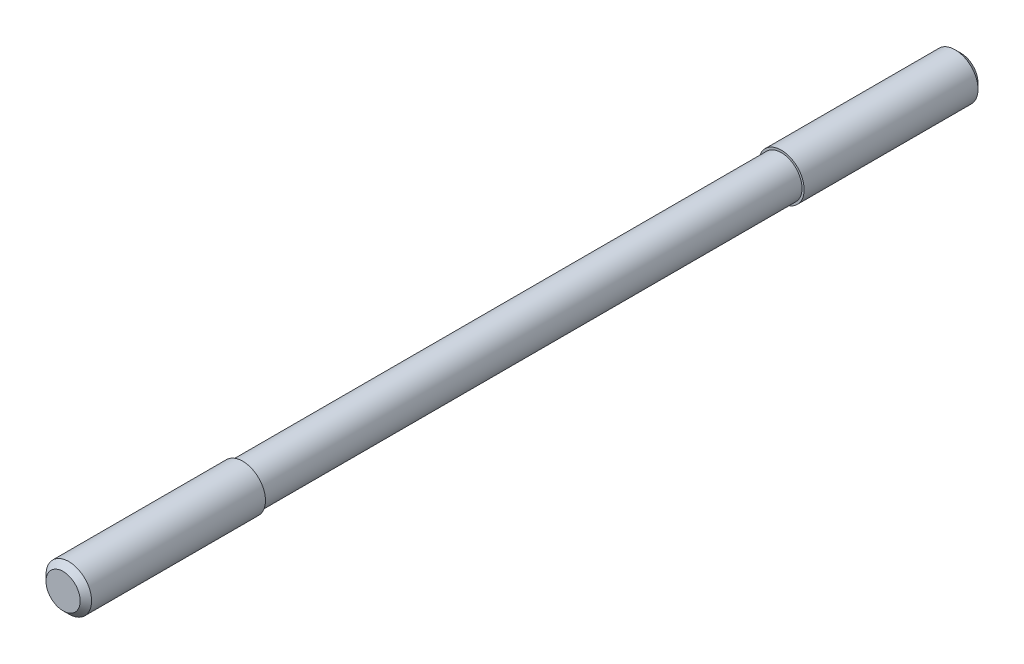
ISO-10303-21;
HEADER;
FILE_DESCRIPTION(('STEP AP214'),'2;1');
FILE_NAME('part.step','',(''),(''),'','','');
FILE_SCHEMA(('AUTOMOTIVE_DESIGN { 1 0 10303 214 1 1 1 1 }'));
ENDSEC;
DATA;
#1=APPLICATION_CONTEXT('core data for automotive mechanical design processes');
#2=APPLICATION_PROTOCOL_DEFINITION('international standard','automotive_design',2000,#1);
#3=PRODUCT_CONTEXT('',#1,'mechanical');
#4=PRODUCT('Part','Part','',(#3));
#5=PRODUCT_RELATED_PRODUCT_CATEGORY('part','',(#4));
#6=PRODUCT_DEFINITION_FORMATION('','',#4);
#7=PRODUCT_DEFINITION_CONTEXT('part definition',#1,'design');
#8=PRODUCT_DEFINITION('design','',#6,#7);
#9=PRODUCT_DEFINITION_SHAPE('','',#8);
#10=(LENGTH_UNIT() NAMED_UNIT(*) SI_UNIT(.MILLI.,.METRE.));
#11=(NAMED_UNIT(*) PLANE_ANGLE_UNIT() SI_UNIT($,.RADIAN.));
#12=(NAMED_UNIT(*) SI_UNIT($,.STERADIAN.) SOLID_ANGLE_UNIT());
#13=UNCERTAINTY_MEASURE_WITH_UNIT(LENGTH_MEASURE(1.E-05),#10,'distance_accuracy_value','');
#14=(GEOMETRIC_REPRESENTATION_CONTEXT(3) GLOBAL_UNCERTAINTY_ASSIGNED_CONTEXT((#13)) GLOBAL_UNIT_ASSIGNED_CONTEXT((#10,
#11,#12)) REPRESENTATION_CONTEXT('',''));
#15=CARTESIAN_POINT('',(0.,0.,0.));
#16=DIRECTION('',(0.,0.,1.));
#17=DIRECTION('',(1.,0.,0.));
#18=AXIS2_PLACEMENT_3D('',#15,#16,#17);
#19=CARTESIAN_POINT('',(0.,0.,0.));
#20=DIRECTION('',(0.,0.,1.));
#21=DIRECTION('',(1.,0.,0.));
#22=AXIS2_PLACEMENT_3D('',#19,#20,#21);
#23=PLANE('',#22);
#24=CARTESIAN_POINT('',(0.,0.,0.));
#25=DIRECTION('',(0.,0.,1.));
#26=DIRECTION('',(1.,0.,0.));
#27=AXIS2_PLACEMENT_3D('',#24,#25,#26);
#28=CIRCLE('',#27,6.);
#29=CARTESIAN_POINT('',(6.,0.,0.));
#30=VERTEX_POINT('',#29);
#31=EDGE_CURVE('E8',#30,#30,#28,.T.);
#32=ORIENTED_EDGE('',*,*,#31,.F.);
#33=EDGE_LOOP('',(#32));
#34=FACE_BOUND('',#33,.T.);
#35=ADVANCED_FACE('F12',(#34),#23,.F.);
#36=CARTESIAN_POINT('',(0.,0.,2.));
#37=DIRECTION('',(0.,0.,1.));
#38=DIRECTION('',(1.,0.,0.));
#39=AXIS2_PLACEMENT_3D('',#36,#37,#38);
#40=CONICAL_SURFACE('',#39,8.,0.785398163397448);
#41=ORIENTED_EDGE('',*,*,#31,.T.);
#42=EDGE_LOOP('',(#41));
#43=FACE_BOUND('',#42,.T.);
#44=CARTESIAN_POINT('',(0.,0.,2.));
#45=DIRECTION('',(0.,0.,1.));
#46=DIRECTION('',(1.,0.,0.));
#47=AXIS2_PLACEMENT_3D('',#44,#45,#46);
#48=CIRCLE('',#47,8.);
#49=CARTESIAN_POINT('',(8.,0.,2.));
#50=VERTEX_POINT('',#49);
#51=EDGE_CURVE('E18',#50,#50,#48,.T.);
#52=ORIENTED_EDGE('',*,*,#51,.F.);
#53=EDGE_LOOP('',(#52));
#54=FACE_BOUND('',#53,.T.);
#55=ADVANCED_FACE('F61',(#43,#54),#40,.T.);
#56=CARTESIAN_POINT('',(0.,0.,70.));
#57=DIRECTION('',(0.,0.,1.));
#58=DIRECTION('',(1.,0.,0.));
#59=AXIS2_PLACEMENT_3D('',#56,#57,#58);
#60=CYLINDRICAL_SURFACE('',#59,8.);
#61=CARTESIAN_POINT('',(0.,0.,63.));
#62=DIRECTION('',(0.,0.,1.));
#63=DIRECTION('',(1.,0.,0.));
#64=AXIS2_PLACEMENT_3D('',#61,#62,#63);
#65=CIRCLE('',#64,8.);
#66=CARTESIAN_POINT('',(8.,0.,63.));
#67=VERTEX_POINT('',#66);
#68=EDGE_CURVE('E22',#67,#67,#65,.T.);
#69=ORIENTED_EDGE('',*,*,#68,.F.);
#70=EDGE_LOOP('',(#69));
#71=FACE_BOUND('',#70,.T.);
#72=ORIENTED_EDGE('',*,*,#51,.T.);
#73=EDGE_LOOP('',(#72));
#74=FACE_BOUND('',#73,.T.);
#75=ADVANCED_FACE('F66',(#71,#74),#60,.T.);
#76=CARTESIAN_POINT('',(8.,0.,63.));
#77=DIRECTION('',(0.,0.,-1.));
#78=DIRECTION('',(-1.,0.,0.));
#79=AXIS2_PLACEMENT_3D('',#76,#77,#78);
#80=PLANE('',#79);
#81=CARTESIAN_POINT('',(0.,0.,63.));
#82=DIRECTION('',(0.,0.,1.));
#83=DIRECTION('',(1.,0.,0.));
#84=AXIS2_PLACEMENT_3D('',#81,#82,#83);
#85=CIRCLE('',#84,7.25);
#86=CARTESIAN_POINT('',(7.25,0.,63.));
#87=VERTEX_POINT('',#86);
#88=EDGE_CURVE('E26',#87,#87,#85,.T.);
#89=ORIENTED_EDGE('',*,*,#88,.F.);
#90=EDGE_LOOP('',(#89));
#91=FACE_BOUND('',#90,.T.);
#92=ORIENTED_EDGE('',*,*,#68,.T.);
#93=EDGE_LOOP('',(#92));
#94=FACE_BOUND('',#93,.T.);
#95=ADVANCED_FACE('F70',(#91,#94),#80,.F.);
#96=CARTESIAN_POINT('',(0.,0.,70.));
#97=DIRECTION('',(0.,0.,1.));
#98=DIRECTION('',(1.,0.,0.));
#99=AXIS2_PLACEMENT_3D('',#96,#97,#98);
#100=CYLINDRICAL_SURFACE('',#99,7.25);
#101=CARTESIAN_POINT('',(0.,0.,252.));
#102=DIRECTION('',(0.,0.,1.));
#103=DIRECTION('',(1.,0.,0.));
#104=AXIS2_PLACEMENT_3D('',#101,#102,#103);
#105=CIRCLE('',#104,7.25);
#106=CARTESIAN_POINT('',(7.25,0.,252.));
#107=VERTEX_POINT('',#106);
#108=EDGE_CURVE('E31',#107,#107,#105,.T.);
#109=ORIENTED_EDGE('',*,*,#108,.F.);
#110=EDGE_LOOP('',(#109));
#111=FACE_BOUND('',#110,.T.);
#112=ORIENTED_EDGE('',*,*,#88,.T.);
#113=EDGE_LOOP('',(#112));
#114=FACE_BOUND('',#113,.T.);
#115=ADVANCED_FACE('F77',(#111,#114),#100,.T.);
#116=CARTESIAN_POINT('',(7.25,0.,252.));
#117=DIRECTION('',(0.,0.,1.));
#118=DIRECTION('',(1.,0.,0.));
#119=AXIS2_PLACEMENT_3D('',#116,#117,#118);
#120=PLANE('',#119);
#121=CARTESIAN_POINT('',(0.,0.,252.));
#122=DIRECTION('',(0.,0.,1.));
#123=DIRECTION('',(1.,0.,0.));
#124=AXIS2_PLACEMENT_3D('',#121,#122,#123);
#125=CIRCLE('',#124,8.);
#126=CARTESIAN_POINT('',(8.,0.,252.));
#127=VERTEX_POINT('',#126);
#128=EDGE_CURVE('E34',#127,#127,#125,.T.);
#129=ORIENTED_EDGE('',*,*,#128,.F.);
#130=EDGE_LOOP('',(#129));
#131=FACE_BOUND('',#130,.T.);
#132=ORIENTED_EDGE('',*,*,#108,.T.);
#133=EDGE_LOOP('',(#132));
#134=FACE_BOUND('',#133,.T.);
#135=ADVANCED_FACE('F57',(#131,#134),#120,.F.);
#136=CARTESIAN_POINT('',(0.,0.,70.));
#137=DIRECTION('',(0.,0.,1.));
#138=DIRECTION('',(1.,0.,0.));
#139=AXIS2_PLACEMENT_3D('',#136,#137,#138);
#140=CYLINDRICAL_SURFACE('',#139,8.);
#141=CARTESIAN_POINT('',(0.,0.,313.));
#142=DIRECTION('',(0.,0.,1.));
#143=DIRECTION('',(1.,0.,0.));
#144=AXIS2_PLACEMENT_3D('',#141,#142,#143);
#145=CIRCLE('',#144,8.);
#146=CARTESIAN_POINT('',(8.,0.,313.));
#147=VERTEX_POINT('',#146);
#148=EDGE_CURVE('E37',#147,#147,#145,.T.);
#149=ORIENTED_EDGE('',*,*,#148,.F.);
#150=EDGE_LOOP('',(#149));
#151=FACE_BOUND('',#150,.T.);
#152=ORIENTED_EDGE('',*,*,#128,.T.);
#153=EDGE_LOOP('',(#152));
#154=FACE_BOUND('',#153,.T.);
#155=ADVANCED_FACE('F48',(#151,#154),#140,.T.);
#156=CARTESIAN_POINT('',(0.,0.,315.));
#157=DIRECTION('',(0.,0.,-1.));
#158=DIRECTION('',(-1.,0.,0.));
#159=AXIS2_PLACEMENT_3D('',#156,#157,#158);
#160=CONICAL_SURFACE('',#159,6.,0.785398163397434);
#161=ORIENTED_EDGE('',*,*,#148,.T.);
#162=EDGE_LOOP('',(#161));
#163=FACE_BOUND('',#162,.T.);
#164=CARTESIAN_POINT('',(0.,0.,315.));
#165=DIRECTION('',(0.,0.,1.));
#166=DIRECTION('',(1.,0.,0.));
#167=AXIS2_PLACEMENT_3D('',#164,#165,#166);
#168=CIRCLE('',#167,6.);
#169=CARTESIAN_POINT('',(6.,0.,315.));
#170=VERTEX_POINT('',#169);
#171=EDGE_CURVE('E40',#170,#170,#168,.T.);
#172=ORIENTED_EDGE('',*,*,#171,.F.);
#173=EDGE_LOOP('',(#172));
#174=FACE_BOUND('',#173,.T.);
#175=ADVANCED_FACE('F46',(#163,#174),#160,.T.);
#176=CARTESIAN_POINT('',(6.,0.,315.));
#177=DIRECTION('',(0.,0.,-1.));
#178=DIRECTION('',(-1.,0.,0.));
#179=AXIS2_PLACEMENT_3D('',#176,#177,#178);
#180=PLANE('',#179);
#181=ORIENTED_EDGE('',*,*,#171,.T.);
#182=EDGE_LOOP('',(#181));
#183=FACE_BOUND('',#182,.T.);
#184=ADVANCED_FACE('F44',(#183),#180,.F.);
#185=CLOSED_SHELL('',(#35,#55,#75,#95,#115,#135,#155,#175,#184));
#186=MANIFOLD_SOLID_BREP('B1',#185);
#187=ADVANCED_BREP_SHAPE_REPRESENTATION('',(#18,#186),#14);
#188=SHAPE_DEFINITION_REPRESENTATION(#9,#187);
ENDSEC;
END-ISO-10303-21;
